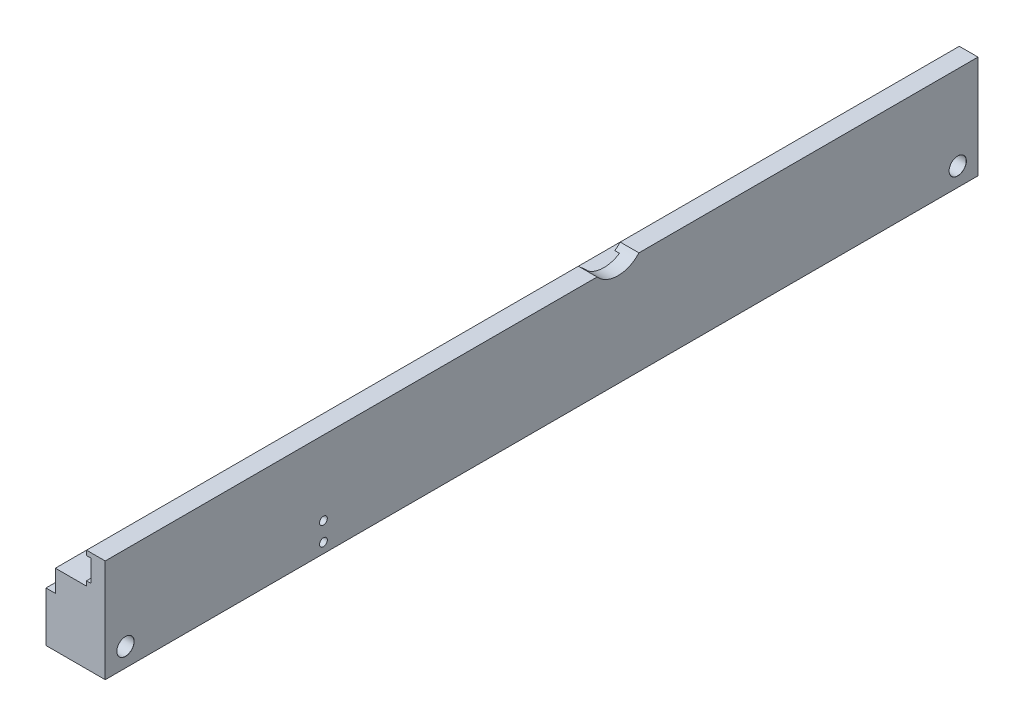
ISO-10303-21;
HEADER;
FILE_DESCRIPTION(('STEP AP214'),'2;1');
FILE_NAME('part.step','',(''),(''),'','','');
FILE_SCHEMA(('AUTOMOTIVE_DESIGN { 1 0 10303 214 1 1 1 1 }'));
ENDSEC;
DATA;
#1=APPLICATION_CONTEXT('core data for automotive mechanical design processes');
#2=APPLICATION_PROTOCOL_DEFINITION('international standard','automotive_design',2000,#1);
#3=PRODUCT_CONTEXT('',#1,'mechanical');
#4=PRODUCT('Part','Part','',(#3));
#5=PRODUCT_RELATED_PRODUCT_CATEGORY('part','',(#4));
#6=PRODUCT_DEFINITION_FORMATION('','',#4);
#7=PRODUCT_DEFINITION_CONTEXT('part definition',#1,'design');
#8=PRODUCT_DEFINITION('design','',#6,#7);
#9=PRODUCT_DEFINITION_SHAPE('','',#8);
#10=(LENGTH_UNIT() NAMED_UNIT(*) SI_UNIT(.MILLI.,.METRE.));
#11=(NAMED_UNIT(*) PLANE_ANGLE_UNIT() SI_UNIT($,.RADIAN.));
#12=(NAMED_UNIT(*) SI_UNIT($,.STERADIAN.) SOLID_ANGLE_UNIT());
#13=UNCERTAINTY_MEASURE_WITH_UNIT(LENGTH_MEASURE(1.E-05),#10,'distance_accuracy_value','');
#14=(GEOMETRIC_REPRESENTATION_CONTEXT(3) GLOBAL_UNCERTAINTY_ASSIGNED_CONTEXT((#13)) GLOBAL_UNIT_ASSIGNED_CONTEXT((#10,
#11,#12)) REPRESENTATION_CONTEXT('',''));
#15=CARTESIAN_POINT('',(0.,0.,0.));
#16=DIRECTION('',(0.,0.,1.));
#17=DIRECTION('',(1.,0.,0.));
#18=AXIS2_PLACEMENT_3D('',#15,#16,#17);
#19=CARTESIAN_POINT('',(-159.,251.054588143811,280.));
#20=DIRECTION('',(0.,-1.,0.));
#21=DIRECTION('',(0.,0.,-1.));
#22=AXIS2_PLACEMENT_3D('',#19,#20,#21);
#23=PLANE('',#22);
#24=DIRECTION('',(0.,0.,-1.));
#25=VECTOR('',#24,1.);
#26=CARTESIAN_POINT('',(-165.,251.054588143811,280.));
#27=LINE('',#26,#25);
#28=CARTESIAN_POINT('',(-165.,251.054588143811,108.791796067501));
#29=VERTEX_POINT('',#28);
#30=CARTESIAN_POINT('',(-165.,251.054588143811,0.));
#31=VERTEX_POINT('',#30);
#32=EDGE_CURVE('E330',#29,#31,#27,.T.);
#33=ORIENTED_EDGE('',*,*,#32,.F.);
#34=DIRECTION('',(1.,0.,0.));
#35=VECTOR('',#34,1.);
#36=CARTESIAN_POINT('',(-178.,251.054588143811,108.791796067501));
#37=LINE('',#36,#35);
#38=CARTESIAN_POINT('',(-159.,251.054588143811,108.791796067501));
#39=VERTEX_POINT('',#38);
#40=EDGE_CURVE('E232',#29,#39,#37,.T.);
#41=ORIENTED_EDGE('',*,*,#40,.T.);
#42=DIRECTION('',(0.,0.,-1.));
#43=VECTOR('',#42,1.);
#44=CARTESIAN_POINT('',(-159.,251.054588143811,280.));
#45=LINE('',#44,#43);
#46=CARTESIAN_POINT('',(-159.,251.054588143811,0.));
#47=VERTEX_POINT('',#46);
#48=EDGE_CURVE('E334',#39,#47,#45,.T.);
#49=ORIENTED_EDGE('',*,*,#48,.T.);
#50=DIRECTION('',(-1.,0.,0.));
#51=VECTOR('',#50,1.);
#52=CARTESIAN_POINT('',(-159.,251.054588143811,0.));
#53=LINE('',#52,#51);
#54=EDGE_CURVE('E316',#47,#31,#53,.T.);
#55=ORIENTED_EDGE('',*,*,#54,.T.);
#56=EDGE_LOOP('',(#33,#41,#49,#55));
#57=FACE_BOUND('',#56,.T.);
#58=ADVANCED_FACE('F16',(#57),#23,.F.);
#59=CARTESIAN_POINT('',(-165.,251.054588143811,280.));
#60=DIRECTION('',(1.,0.,0.));
#61=DIRECTION('',(0.,0.,-1.));
#62=AXIS2_PLACEMENT_3D('',#59,#60,#61);
#63=PLANE('',#62);
#64=CARTESIAN_POINT('',(-165.,251.054588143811,280.));
#65=VERTEX_POINT('',#64);
#66=CARTESIAN_POINT('',(-165.,251.054588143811,122.208203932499));
#67=VERTEX_POINT('',#66);
#68=EDGE_CURVE('E331',#65,#67,#27,.T.);
#69=ORIENTED_EDGE('',*,*,#68,.T.);
#70=CARTESIAN_POINT('',(-165.,257.054588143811,115.5));
#71=DIRECTION('',(1.,0.,0.));
#72=DIRECTION('',(0.,0.,-1.));
#73=AXIS2_PLACEMENT_3D('',#70,#71,#72);
#74=CIRCLE('',#73,9.);
#75=CARTESIAN_POINT('',(-165.,249.55458814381,120.474937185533));
#76=VERTEX_POINT('',#75);
#77=EDGE_CURVE('E233',#67,#76,#74,.T.);
#78=ORIENTED_EDGE('',*,*,#77,.T.);
#79=DIRECTION('',(0.,0.,-1.));
#80=VECTOR('',#79,1.);
#81=CARTESIAN_POINT('',(-165.,249.55458814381,280.));
#82=LINE('',#81,#80);
#83=CARTESIAN_POINT('',(-165.,249.55458814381,280.));
#84=VERTEX_POINT('',#83);
#85=EDGE_CURVE('E297',#84,#76,#82,.T.);
#86=ORIENTED_EDGE('',*,*,#85,.F.);
#87=DIRECTION('',(0.,-1.,0.));
#88=VECTOR('',#87,1.);
#89=CARTESIAN_POINT('',(-165.,251.054588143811,280.));
#90=LINE('',#89,#88);
#91=EDGE_CURVE('E306',#65,#84,#90,.T.);
#92=ORIENTED_EDGE('',*,*,#91,.F.);
#93=EDGE_LOOP('',(#69,#78,#86,#92));
#94=FACE_BOUND('',#93,.T.);
#95=ADVANCED_FACE('F365',(#94),#63,.F.);
#96=CARTESIAN_POINT('',(-163.5,249.55458814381,280.));
#97=DIRECTION('',(0.,1.,0.));
#98=DIRECTION('',(0.,0.,1.));
#99=AXIS2_PLACEMENT_3D('',#96,#97,#98);
#100=PLANE('',#99);
#101=ORIENTED_EDGE('',*,*,#85,.T.);
#102=DIRECTION('',(1.,0.,0.));
#103=VECTOR('',#102,1.);
#104=CARTESIAN_POINT('',(-178.,249.55458814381,120.474937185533));
#105=LINE('',#104,#103);
#106=CARTESIAN_POINT('',(-163.5,249.55458814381,120.474937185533));
#107=VERTEX_POINT('',#106);
#108=EDGE_CURVE('E11',#76,#107,#105,.T.);
#109=ORIENTED_EDGE('',*,*,#108,.T.);
#110=DIRECTION('',(0.,0.,-1.));
#111=VECTOR('',#110,1.);
#112=CARTESIAN_POINT('',(-163.5,249.55458814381,280.));
#113=LINE('',#112,#111);
#114=CARTESIAN_POINT('',(-163.5,249.55458814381,280.));
#115=VERTEX_POINT('',#114);
#116=EDGE_CURVE('E293',#115,#107,#113,.T.);
#117=ORIENTED_EDGE('',*,*,#116,.F.);
#118=DIRECTION('',(1.,0.,0.));
#119=VECTOR('',#118,1.);
#120=CARTESIAN_POINT('',(-163.5,249.55458814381,280.));
#121=LINE('',#120,#119);
#122=EDGE_CURVE('E256',#84,#115,#121,.T.);
#123=ORIENTED_EDGE('',*,*,#122,.F.);
#124=EDGE_LOOP('',(#101,#109,#117,#123));
#125=FACE_BOUND('',#124,.T.);
#126=ADVANCED_FACE('F361',(#125),#100,.F.);
#127=CARTESIAN_POINT('',(-159.,218.05458814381,280.));
#128=DIRECTION('',(-1.,0.,0.));
#129=DIRECTION('',(0.,0.,1.));
#130=AXIS2_PLACEMENT_3D('',#127,#128,#129);
#131=PLANE('',#130);
#132=CARTESIAN_POINT('',(-159.,224.05458814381,273.5));
#133=DIRECTION('',(-1.,0.,0.));
#134=DIRECTION('',(0.,0.,1.));
#135=AXIS2_PLACEMENT_3D('',#132,#133,#134);
#136=CIRCLE('',#135,2.775);
#137=CARTESIAN_POINT('',(-159.,224.05458814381,276.275));
#138=VERTEX_POINT('',#137);
#139=EDGE_CURVE('E172',#138,#138,#136,.T.);
#140=ORIENTED_EDGE('',*,*,#139,.T.);
#141=EDGE_LOOP('',(#140));
#142=FACE_BOUND('',#141,.T.);
#143=CARTESIAN_POINT('',(-159.,224.05458814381,6.5));
#144=DIRECTION('',(-1.,0.,0.));
#145=DIRECTION('',(0.,0.,1.));
#146=AXIS2_PLACEMENT_3D('',#143,#144,#145);
#147=CIRCLE('',#146,2.775);
#148=CARTESIAN_POINT('',(-159.,224.05458814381,9.275));
#149=VERTEX_POINT('',#148);
#150=EDGE_CURVE('E193',#149,#149,#147,.T.);
#151=ORIENTED_EDGE('',*,*,#150,.T.);
#152=EDGE_LOOP('',(#151));
#153=FACE_BOUND('',#152,.T.);
#154=CARTESIAN_POINT('',(-159.,221.25458814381,210.));
#155=DIRECTION('',(-1.,0.,0.));
#156=DIRECTION('',(0.,0.,1.));
#157=AXIS2_PLACEMENT_3D('',#154,#155,#156);
#158=CIRCLE('',#157,1.25);
#159=CARTESIAN_POINT('',(-159.,221.25458814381,211.25));
#160=VERTEX_POINT('',#159);
#161=EDGE_CURVE('E217',#160,#160,#158,.T.);
#162=ORIENTED_EDGE('',*,*,#161,.T.);
#163=EDGE_LOOP('',(#162));
#164=FACE_BOUND('',#163,.T.);
#165=CARTESIAN_POINT('',(-159.,227.254588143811,210.));
#166=DIRECTION('',(-1.,0.,0.));
#167=DIRECTION('',(0.,0.,1.));
#168=AXIS2_PLACEMENT_3D('',#165,#166,#167);
#169=CIRCLE('',#168,1.25);
#170=CARTESIAN_POINT('',(-159.,227.254588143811,211.25));
#171=VERTEX_POINT('',#170);
#172=EDGE_CURVE('E223',#171,#171,#169,.T.);
#173=ORIENTED_EDGE('',*,*,#172,.T.);
#174=EDGE_LOOP('',(#173));
#175=FACE_BOUND('',#174,.T.);
#176=ORIENTED_EDGE('',*,*,#48,.F.);
#177=CARTESIAN_POINT('',(-159.,257.054588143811,115.5));
#178=DIRECTION('',(1.,0.,0.));
#179=DIRECTION('',(0.,0.,-1.));
#180=AXIS2_PLACEMENT_3D('',#177,#178,#179);
#181=CIRCLE('',#180,9.);
#182=CARTESIAN_POINT('',(-159.,251.054588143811,122.208203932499));
#183=VERTEX_POINT('',#182);
#184=EDGE_CURVE('E226',#183,#39,#181,.T.);
#185=ORIENTED_EDGE('',*,*,#184,.F.);
#186=CARTESIAN_POINT('',(-159.,251.054588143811,280.));
#187=VERTEX_POINT('',#186);
#188=EDGE_CURVE('E335',#187,#183,#45,.T.);
#189=ORIENTED_EDGE('',*,*,#188,.F.);
#190=DIRECTION('',(0.,1.,0.));
#191=VECTOR('',#190,1.);
#192=CARTESIAN_POINT('',(-159.,218.05458814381,280.));
#193=LINE('',#192,#191);
#194=CARTESIAN_POINT('',(-159.,218.05458814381,280.));
#195=VERTEX_POINT('',#194);
#196=EDGE_CURVE('E300',#195,#187,#193,.T.);
#197=ORIENTED_EDGE('',*,*,#196,.F.);
#198=DIRECTION('',(0.,0.,-1.));
#199=VECTOR('',#198,1.);
#200=CARTESIAN_POINT('',(-159.,218.05458814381,280.));
#201=LINE('',#200,#199);
#202=CARTESIAN_POINT('',(-159.,218.05458814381,0.));
#203=VERTEX_POINT('',#202);
#204=EDGE_CURVE('E313',#195,#203,#201,.T.);
#205=ORIENTED_EDGE('',*,*,#204,.T.);
#206=DIRECTION('',(0.,1.,0.));
#207=VECTOR('',#206,1.);
#208=CARTESIAN_POINT('',(-159.,218.05458814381,0.));
#209=LINE('',#208,#207);
#210=EDGE_CURVE('E288',#203,#47,#209,.T.);
#211=ORIENTED_EDGE('',*,*,#210,.T.);
#212=EDGE_LOOP('',(#176,#185,#189,#197,#205,#211));
#213=FACE_BOUND('',#212,.T.);
#214=ADVANCED_FACE('F18',(#142,#153,#164,#175,#213),#131,.F.);
#215=ORIENTED_EDGE('',*,*,#188,.T.);
#216=DIRECTION('',(1.,0.,0.));
#217=VECTOR('',#216,1.);
#218=CARTESIAN_POINT('',(-178.,251.054588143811,122.208203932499));
#219=LINE('',#218,#217);
#220=EDGE_CURVE('E236',#183,#67,#219,.F.);
#221=ORIENTED_EDGE('',*,*,#220,.T.);
#222=ORIENTED_EDGE('',*,*,#68,.F.);
#223=DIRECTION('',(-1.,0.,0.));
#224=VECTOR('',#223,1.);
#225=CARTESIAN_POINT('',(-159.,251.054588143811,280.));
#226=LINE('',#225,#224);
#227=EDGE_CURVE('E303',#187,#65,#226,.T.);
#228=ORIENTED_EDGE('',*,*,#227,.F.);
#229=EDGE_LOOP('',(#215,#221,#222,#228));
#230=FACE_BOUND('',#229,.T.);
#231=ADVANCED_FACE('F372',(#230),#23,.F.);
#232=CARTESIAN_POINT('',(-165.,249.55458814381,110.525062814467));
#233=VERTEX_POINT('',#232);
#234=CARTESIAN_POINT('',(-165.,249.55458814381,0.));
#235=VERTEX_POINT('',#234);
#236=EDGE_CURVE('E272',#233,#235,#82,.T.);
#237=ORIENTED_EDGE('',*,*,#236,.F.);
#238=EDGE_CURVE('E31',#233,#29,#74,.T.);
#239=ORIENTED_EDGE('',*,*,#238,.T.);
#240=ORIENTED_EDGE('',*,*,#32,.T.);
#241=DIRECTION('',(0.,-1.,0.));
#242=VECTOR('',#241,1.);
#243=CARTESIAN_POINT('',(-165.,251.054588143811,0.));
#244=LINE('',#243,#242);
#245=EDGE_CURVE('E319',#31,#235,#244,.T.);
#246=ORIENTED_EDGE('',*,*,#245,.T.);
#247=EDGE_LOOP('',(#237,#239,#240,#246));
#248=FACE_BOUND('',#247,.T.);
#249=ADVANCED_FACE('F343',(#248),#63,.F.);
#250=CARTESIAN_POINT('',(-178.,218.05458814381,280.));
#251=DIRECTION('',(1.,0.,0.));
#252=DIRECTION('',(0.,0.,-1.));
#253=AXIS2_PLACEMENT_3D('',#250,#251,#252);
#254=PLANE('',#253);
#255=CARTESIAN_POINT('',(-178.,224.05458814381,273.5));
#256=DIRECTION('',(-1.,0.,0.));
#257=DIRECTION('',(0.,0.,1.));
#258=AXIS2_PLACEMENT_3D('',#255,#256,#257);
#259=CIRCLE('',#258,5.025);
#260=CARTESIAN_POINT('',(-178.,224.05458814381,278.525));
#261=VERTEX_POINT('',#260);
#262=EDGE_CURVE('E175',#261,#261,#259,.T.);
#263=ORIENTED_EDGE('',*,*,#262,.F.);
#264=EDGE_LOOP('',(#263));
#265=FACE_BOUND('',#264,.T.);
#266=CARTESIAN_POINT('',(-178.,224.05458814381,6.5));
#267=DIRECTION('',(-1.,0.,0.));
#268=DIRECTION('',(0.,0.,1.));
#269=AXIS2_PLACEMENT_3D('',#266,#267,#268);
#270=CIRCLE('',#269,5.025);
#271=CARTESIAN_POINT('',(-178.,224.05458814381,11.525));
#272=VERTEX_POINT('',#271);
#273=EDGE_CURVE('E196',#272,#272,#270,.T.);
#274=ORIENTED_EDGE('',*,*,#273,.F.);
#275=EDGE_LOOP('',(#274));
#276=FACE_BOUND('',#275,.T.);
#277=CARTESIAN_POINT('',(-178.,221.25458814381,210.));
#278=DIRECTION('',(-1.,0.,0.));
#279=DIRECTION('',(0.,0.,1.));
#280=AXIS2_PLACEMENT_3D('',#277,#278,#279);
#281=CIRCLE('',#280,1.25);
#282=CARTESIAN_POINT('',(-178.,221.25458814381,211.25));
#283=VERTEX_POINT('',#282);
#284=EDGE_CURVE('E214',#283,#283,#281,.T.);
#285=ORIENTED_EDGE('',*,*,#284,.F.);
#286=EDGE_LOOP('',(#285));
#287=FACE_BOUND('',#286,.T.);
#288=CARTESIAN_POINT('',(-178.,227.254588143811,210.));
#289=DIRECTION('',(-1.,0.,0.));
#290=DIRECTION('',(0.,0.,1.));
#291=AXIS2_PLACEMENT_3D('',#288,#289,#290);
#292=CIRCLE('',#291,1.24999999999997);
#293=CARTESIAN_POINT('',(-178.,227.254588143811,211.25));
#294=VERTEX_POINT('',#293);
#295=EDGE_CURVE('E220',#294,#294,#292,.T.);
#296=ORIENTED_EDGE('',*,*,#295,.F.);
#297=EDGE_LOOP('',(#296));
#298=FACE_BOUND('',#297,.T.);
#299=DIRECTION('',(0.,-1.,0.));
#300=VECTOR('',#299,1.);
#301=CARTESIAN_POINT('',(-178.,218.05458814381,280.));
#302=LINE('',#301,#300);
#303=CARTESIAN_POINT('',(-178.,234.05458814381,280.));
#304=VERTEX_POINT('',#303);
#305=CARTESIAN_POINT('',(-178.,218.05458814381,280.));
#306=VERTEX_POINT('',#305);
#307=EDGE_CURVE('E309',#304,#306,#302,.T.);
#308=ORIENTED_EDGE('',*,*,#307,.F.);
#309=DIRECTION('',(0.,0.,-1.));
#310=VECTOR('',#309,1.);
#311=CARTESIAN_POINT('',(-178.,234.05458814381,280.));
#312=LINE('',#311,#310);
#313=CARTESIAN_POINT('',(-178.,234.05458814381,0.));
#314=VERTEX_POINT('',#313);
#315=EDGE_CURVE('E249',#304,#314,#312,.T.);
#316=ORIENTED_EDGE('',*,*,#315,.T.);
#317=DIRECTION('',(0.,-1.,0.));
#318=VECTOR('',#317,1.);
#319=CARTESIAN_POINT('',(-178.,218.05458814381,0.));
#320=LINE('',#319,#318);
#321=CARTESIAN_POINT('',(-178.,218.05458814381,0.));
#322=VERTEX_POINT('',#321);
#323=EDGE_CURVE('E322',#314,#322,#320,.T.);
#324=ORIENTED_EDGE('',*,*,#323,.T.);
#325=DIRECTION('',(0.,0.,-1.));
#326=VECTOR('',#325,1.);
#327=CARTESIAN_POINT('',(-178.,218.05458814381,280.));
#328=LINE('',#327,#326);
#329=EDGE_CURVE('E327',#306,#322,#328,.T.);
#330=ORIENTED_EDGE('',*,*,#329,.F.);
#331=EDGE_LOOP('',(#308,#316,#324,#330));
#332=FACE_BOUND('',#331,.T.);
#333=ADVANCED_FACE('F390',(#265,#276,#287,#298,#332),#254,.F.);
#334=CARTESIAN_POINT('',(-159.,218.05458814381,280.));
#335=DIRECTION('',(0.,1.,0.));
#336=DIRECTION('',(0.,0.,1.));
#337=AXIS2_PLACEMENT_3D('',#334,#335,#336);
#338=PLANE('',#337);
#339=CARTESIAN_POINT('',(-169.,218.05458814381,255.5));
#340=DIRECTION('',(0.,-1.,0.));
#341=DIRECTION('',(0.,0.,-1.));
#342=AXIS2_PLACEMENT_3D('',#339,#340,#341);
#343=CIRCLE('',#342,1.65);
#344=CARTESIAN_POINT('',(-169.,218.05458814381,253.85));
#345=VERTEX_POINT('',#344);
#346=EDGE_CURVE('E150',#345,#345,#343,.T.);
#347=ORIENTED_EDGE('',*,*,#346,.F.);
#348=EDGE_LOOP('',(#347));
#349=FACE_BOUND('',#348,.T.);
#350=CARTESIAN_POINT('',(-169.,218.05458814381,236.5));
#351=DIRECTION('',(0.,-1.,0.));
#352=DIRECTION('',(0.,0.,-1.));
#353=AXIS2_PLACEMENT_3D('',#350,#351,#352);
#354=CIRCLE('',#353,1.65);
#355=CARTESIAN_POINT('',(-169.,218.05458814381,234.85));
#356=VERTEX_POINT('',#355);
#357=EDGE_CURVE('E149',#356,#356,#354,.T.);
#358=ORIENTED_EDGE('',*,*,#357,.F.);
#359=EDGE_LOOP('',(#358));
#360=FACE_BOUND('',#359,.T.);
#361=CARTESIAN_POINT('',(-169.,218.05458814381,122.));
#362=DIRECTION('',(0.,-1.,0.));
#363=DIRECTION('',(0.,0.,-1.));
#364=AXIS2_PLACEMENT_3D('',#361,#362,#363);
#365=CIRCLE('',#364,1.65);
#366=CARTESIAN_POINT('',(-169.,218.05458814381,120.35));
#367=VERTEX_POINT('',#366);
#368=EDGE_CURVE('E160',#367,#367,#365,.T.);
#369=ORIENTED_EDGE('',*,*,#368,.F.);
#370=EDGE_LOOP('',(#369));
#371=FACE_BOUND('',#370,.T.);
#372=CARTESIAN_POINT('',(-169.,218.05458814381,106.));
#373=DIRECTION('',(0.,-1.,0.));
#374=DIRECTION('',(0.,0.,-1.));
#375=AXIS2_PLACEMENT_3D('',#372,#373,#374);
#376=CIRCLE('',#375,1.65);
#377=CARTESIAN_POINT('',(-169.,218.05458814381,104.35));
#378=VERTEX_POINT('',#377);
#379=EDGE_CURVE('E166',#378,#378,#376,.T.);
#380=ORIENTED_EDGE('',*,*,#379,.F.);
#381=EDGE_LOOP('',(#380));
#382=FACE_BOUND('',#381,.T.);
#383=DIRECTION('',(1.,0.,0.));
#384=VECTOR('',#383,1.);
#385=CARTESIAN_POINT('',(-159.,218.05458814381,0.));
#386=LINE('',#385,#384);
#387=EDGE_CURVE('E304',#322,#203,#386,.T.);
#388=ORIENTED_EDGE('',*,*,#387,.T.);
#389=ORIENTED_EDGE('',*,*,#204,.F.);
#390=DIRECTION('',(1.,0.,0.));
#391=VECTOR('',#390,1.);
#392=CARTESIAN_POINT('',(-159.,218.05458814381,280.));
#393=LINE('',#392,#391);
#394=EDGE_CURVE('E311',#306,#195,#393,.T.);
#395=ORIENTED_EDGE('',*,*,#394,.F.);
#396=ORIENTED_EDGE('',*,*,#329,.T.);
#397=EDGE_LOOP('',(#388,#389,#395,#396));
#398=FACE_BOUND('',#397,.T.);
#399=ADVANCED_FACE('F414',(#349,#360,#371,#382,#398),#338,.F.);
#400=CARTESIAN_POINT('',(0.,0.,280.));
#401=DIRECTION('',(0.,0.,1.));
#402=DIRECTION('',(1.,0.,0.));
#403=AXIS2_PLACEMENT_3D('',#400,#401,#402);
#404=PLANE('',#403);
#405=DIRECTION('',(-1.,0.,0.));
#406=VECTOR('',#405,1.);
#407=CARTESIAN_POINT('',(-178.,234.05458814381,280.));
#408=LINE('',#407,#406);
#409=CARTESIAN_POINT('',(-175.,234.05458814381,280.));
#410=VERTEX_POINT('',#409);
#411=EDGE_CURVE('E241',#410,#304,#408,.T.);
#412=ORIENTED_EDGE('',*,*,#411,.T.);
#413=ORIENTED_EDGE('',*,*,#307,.T.);
#414=ORIENTED_EDGE('',*,*,#394,.T.);
#415=ORIENTED_EDGE('',*,*,#196,.T.);
#416=ORIENTED_EDGE('',*,*,#227,.T.);
#417=ORIENTED_EDGE('',*,*,#91,.T.);
#418=ORIENTED_EDGE('',*,*,#122,.T.);
#419=DIRECTION('',(0.,-1.,0.));
#420=VECTOR('',#419,1.);
#421=CARTESIAN_POINT('',(-163.5,242.55458814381,280.));
#422=LINE('',#421,#420);
#423=CARTESIAN_POINT('',(-163.5,242.55458814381,280.));
#424=VERTEX_POINT('',#423);
#425=EDGE_CURVE('E259',#115,#424,#422,.T.);
#426=ORIENTED_EDGE('',*,*,#425,.T.);
#427=DIRECTION('',(-1.,0.,0.));
#428=VECTOR('',#427,1.);
#429=CARTESIAN_POINT('',(-163.5,242.55458814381,280.));
#430=LINE('',#429,#428);
#431=CARTESIAN_POINT('',(-165.,242.55458814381,280.));
#432=VERTEX_POINT('',#431);
#433=EDGE_CURVE('E263',#424,#432,#430,.T.);
#434=ORIENTED_EDGE('',*,*,#433,.T.);
#435=DIRECTION('',(0.,-1.,0.));
#436=VECTOR('',#435,1.);
#437=CARTESIAN_POINT('',(-165.,242.55458814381,280.));
#438=LINE('',#437,#436);
#439=CARTESIAN_POINT('',(-165.,241.05458814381,280.));
#440=VERTEX_POINT('',#439);
#441=EDGE_CURVE('E266',#432,#440,#438,.T.);
#442=ORIENTED_EDGE('',*,*,#441,.T.);
#443=DIRECTION('',(-1.,0.,0.));
#444=VECTOR('',#443,1.);
#445=CARTESIAN_POINT('',(-178.,241.05458814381,280.));
#446=LINE('',#445,#444);
#447=CARTESIAN_POINT('',(-175.,241.05458814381,280.));
#448=VERTEX_POINT('',#447);
#449=EDGE_CURVE('E269',#440,#448,#446,.T.);
#450=ORIENTED_EDGE('',*,*,#449,.T.);
#451=DIRECTION('',(0.,-1.,0.));
#452=VECTOR('',#451,1.);
#453=CARTESIAN_POINT('',(-175.,234.05458814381,280.));
#454=LINE('',#453,#452);
#455=EDGE_CURVE('E39',#448,#410,#454,.T.);
#456=ORIENTED_EDGE('',*,*,#455,.T.);
#457=EDGE_LOOP('',(#412,#413,#414,#415,#416,#417,#418,#426,#434,#442,#450,#456));
#458=FACE_BOUND('',#457,.T.);
#459=ADVANCED_FACE('F367',(#458),#404,.T.);
#460=CARTESIAN_POINT('',(0.,0.,0.));
#461=DIRECTION('',(0.,0.,1.));
#462=DIRECTION('',(1.,0.,0.));
#463=AXIS2_PLACEMENT_3D('',#460,#461,#462);
#464=PLANE('',#463);
#465=ORIENTED_EDGE('',*,*,#323,.F.);
#466=DIRECTION('',(-1.,0.,0.));
#467=VECTOR('',#466,1.);
#468=CARTESIAN_POINT('',(-178.,234.05458814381,0.));
#469=LINE('',#468,#467);
#470=CARTESIAN_POINT('',(-175.,234.05458814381,0.));
#471=VERTEX_POINT('',#470);
#472=EDGE_CURVE('E242',#471,#314,#469,.T.);
#473=ORIENTED_EDGE('',*,*,#472,.F.);
#474=DIRECTION('',(0.,-1.,0.));
#475=VECTOR('',#474,1.);
#476=CARTESIAN_POINT('',(-175.,234.05458814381,0.));
#477=LINE('',#476,#475);
#478=CARTESIAN_POINT('',(-175.,241.05458814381,0.));
#479=VERTEX_POINT('',#478);
#480=EDGE_CURVE('E239',#479,#471,#477,.T.);
#481=ORIENTED_EDGE('',*,*,#480,.F.);
#482=DIRECTION('',(-1.,0.,0.));
#483=VECTOR('',#482,1.);
#484=CARTESIAN_POINT('',(-178.,241.05458814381,0.));
#485=LINE('',#484,#483);
#486=CARTESIAN_POINT('',(-165.,241.05458814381,0.));
#487=VERTEX_POINT('',#486);
#488=EDGE_CURVE('E260',#487,#479,#485,.T.);
#489=ORIENTED_EDGE('',*,*,#488,.F.);
#490=DIRECTION('',(0.,-1.,0.));
#491=VECTOR('',#490,1.);
#492=CARTESIAN_POINT('',(-165.,242.55458814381,0.));
#493=LINE('',#492,#491);
#494=CARTESIAN_POINT('',(-165.,242.55458814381,0.));
#495=VERTEX_POINT('',#494);
#496=EDGE_CURVE('E281',#495,#487,#493,.T.);
#497=ORIENTED_EDGE('',*,*,#496,.F.);
#498=DIRECTION('',(-1.,0.,0.));
#499=VECTOR('',#498,1.);
#500=CARTESIAN_POINT('',(-163.5,242.55458814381,0.));
#501=LINE('',#500,#499);
#502=CARTESIAN_POINT('',(-163.5,242.55458814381,0.));
#503=VERTEX_POINT('',#502);
#504=EDGE_CURVE('E278',#503,#495,#501,.T.);
#505=ORIENTED_EDGE('',*,*,#504,.F.);
#506=DIRECTION('',(0.,-1.,0.));
#507=VECTOR('',#506,1.);
#508=CARTESIAN_POINT('',(-163.5,242.55458814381,0.));
#509=LINE('',#508,#507);
#510=CARTESIAN_POINT('',(-163.5,249.55458814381,0.));
#511=VERTEX_POINT('',#510);
#512=EDGE_CURVE('E275',#511,#503,#509,.T.);
#513=ORIENTED_EDGE('',*,*,#512,.F.);
#514=DIRECTION('',(1.,0.,0.));
#515=VECTOR('',#514,1.);
#516=CARTESIAN_POINT('',(-163.5,249.55458814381,0.));
#517=LINE('',#516,#515);
#518=EDGE_CURVE('E252',#235,#511,#517,.T.);
#519=ORIENTED_EDGE('',*,*,#518,.F.);
#520=ORIENTED_EDGE('',*,*,#245,.F.);
#521=ORIENTED_EDGE('',*,*,#54,.F.);
#522=ORIENTED_EDGE('',*,*,#210,.F.);
#523=ORIENTED_EDGE('',*,*,#387,.F.);
#524=EDGE_LOOP('',(#465,#473,#481,#489,#497,#505,#513,#519,#520,#521,#522,#523));
#525=FACE_BOUND('',#524,.T.);
#526=ADVANCED_FACE('F349',(#525),#464,.F.);
#527=CARTESIAN_POINT('',(-178.,241.05458814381,280.));
#528=DIRECTION('',(0.,-1.,0.));
#529=DIRECTION('',(0.,0.,-1.));
#530=AXIS2_PLACEMENT_3D('',#527,#528,#529);
#531=PLANE('',#530);
#532=ORIENTED_EDGE('',*,*,#488,.T.);
#533=DIRECTION('',(0.,0.,-1.));
#534=VECTOR('',#533,1.);
#535=CARTESIAN_POINT('',(-175.,241.05458814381,280.));
#536=LINE('',#535,#534);
#537=EDGE_CURVE('E245',#448,#479,#536,.T.);
#538=ORIENTED_EDGE('',*,*,#537,.F.);
#539=ORIENTED_EDGE('',*,*,#449,.F.);
#540=DIRECTION('',(0.,0.,-1.));
#541=VECTOR('',#540,1.);
#542=CARTESIAN_POINT('',(-165.,241.05458814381,280.));
#543=LINE('',#542,#541);
#544=EDGE_CURVE('E286',#440,#487,#543,.T.);
#545=ORIENTED_EDGE('',*,*,#544,.T.);
#546=EDGE_LOOP('',(#532,#538,#539,#545));
#547=FACE_BOUND('',#546,.T.);
#548=ADVANCED_FACE('F441',(#547),#531,.F.);
#549=CARTESIAN_POINT('',(-165.,242.55458814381,280.));
#550=DIRECTION('',(1.,0.,0.));
#551=DIRECTION('',(0.,0.,-1.));
#552=AXIS2_PLACEMENT_3D('',#549,#550,#551);
#553=PLANE('',#552);
#554=ORIENTED_EDGE('',*,*,#496,.T.);
#555=ORIENTED_EDGE('',*,*,#544,.F.);
#556=ORIENTED_EDGE('',*,*,#441,.F.);
#557=DIRECTION('',(0.,0.,-1.));
#558=VECTOR('',#557,1.);
#559=CARTESIAN_POINT('',(-165.,242.55458814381,280.));
#560=LINE('',#559,#558);
#561=EDGE_CURVE('E289',#432,#495,#560,.T.);
#562=ORIENTED_EDGE('',*,*,#561,.T.);
#563=EDGE_LOOP('',(#554,#555,#556,#562));
#564=FACE_BOUND('',#563,.T.);
#565=ADVANCED_FACE('F449',(#564),#553,.F.);
#566=CARTESIAN_POINT('',(-163.5,242.55458814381,280.));
#567=DIRECTION('',(0.,-1.,0.));
#568=DIRECTION('',(0.,0.,-1.));
#569=AXIS2_PLACEMENT_3D('',#566,#567,#568);
#570=PLANE('',#569);
#571=ORIENTED_EDGE('',*,*,#504,.T.);
#572=ORIENTED_EDGE('',*,*,#561,.F.);
#573=ORIENTED_EDGE('',*,*,#433,.F.);
#574=DIRECTION('',(0.,0.,-1.));
#575=VECTOR('',#574,1.);
#576=CARTESIAN_POINT('',(-163.5,242.55458814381,280.));
#577=LINE('',#576,#575);
#578=EDGE_CURVE('E291',#424,#503,#577,.T.);
#579=ORIENTED_EDGE('',*,*,#578,.T.);
#580=EDGE_LOOP('',(#571,#572,#573,#579));
#581=FACE_BOUND('',#580,.T.);
#582=ADVANCED_FACE('F446',(#581),#570,.F.);
#583=CARTESIAN_POINT('',(-163.5,242.55458814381,280.));
#584=DIRECTION('',(1.,0.,0.));
#585=DIRECTION('',(0.,0.,-1.));
#586=AXIS2_PLACEMENT_3D('',#583,#584,#585);
#587=PLANE('',#586);
#588=ORIENTED_EDGE('',*,*,#116,.T.);
#589=CARTESIAN_POINT('',(-163.5,257.054588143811,115.5));
#590=DIRECTION('',(1.,0.,0.));
#591=DIRECTION('',(0.,0.,-1.));
#592=AXIS2_PLACEMENT_3D('',#589,#590,#591);
#593=CIRCLE('',#592,9.);
#594=CARTESIAN_POINT('',(-163.5,249.55458814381,110.525062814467));
#595=VERTEX_POINT('',#594);
#596=EDGE_CURVE('E228',#107,#595,#593,.T.);
#597=ORIENTED_EDGE('',*,*,#596,.T.);
#598=EDGE_CURVE('E296',#595,#511,#113,.T.);
#599=ORIENTED_EDGE('',*,*,#598,.T.);
#600=ORIENTED_EDGE('',*,*,#512,.T.);
#601=ORIENTED_EDGE('',*,*,#578,.F.);
#602=ORIENTED_EDGE('',*,*,#425,.F.);
#603=EDGE_LOOP('',(#588,#597,#599,#600,#601,#602));
#604=FACE_BOUND('',#603,.T.);
#605=ADVANCED_FACE('F355',(#604),#587,.F.);
#606=ORIENTED_EDGE('',*,*,#598,.F.);
#607=DIRECTION('',(1.,0.,0.));
#608=VECTOR('',#607,1.);
#609=CARTESIAN_POINT('',(-178.,249.55458814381,110.525062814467));
#610=LINE('',#609,#608);
#611=EDGE_CURVE('E24',#595,#233,#610,.F.);
#612=ORIENTED_EDGE('',*,*,#611,.T.);
#613=ORIENTED_EDGE('',*,*,#236,.T.);
#614=ORIENTED_EDGE('',*,*,#518,.T.);
#615=EDGE_LOOP('',(#606,#612,#613,#614));
#616=FACE_BOUND('',#615,.T.);
#617=ADVANCED_FACE('F340',(#616),#100,.F.);
#618=CARTESIAN_POINT('',(-178.,234.05458814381,280.));
#619=DIRECTION('',(0.,-1.,0.));
#620=DIRECTION('',(0.,0.,-1.));
#621=AXIS2_PLACEMENT_3D('',#618,#619,#620);
#622=PLANE('',#621);
#623=ORIENTED_EDGE('',*,*,#472,.T.);
#624=ORIENTED_EDGE('',*,*,#315,.F.);
#625=ORIENTED_EDGE('',*,*,#411,.F.);
#626=DIRECTION('',(0.,0.,-1.));
#627=VECTOR('',#626,1.);
#628=CARTESIAN_POINT('',(-175.,234.05458814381,280.));
#629=LINE('',#628,#627);
#630=EDGE_CURVE('E253',#410,#471,#629,.T.);
#631=ORIENTED_EDGE('',*,*,#630,.T.);
#632=EDGE_LOOP('',(#623,#624,#625,#631));
#633=FACE_BOUND('',#632,.T.);
#634=ADVANCED_FACE('F423',(#633),#622,.F.);
#635=CARTESIAN_POINT('',(-175.,234.05458814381,280.));
#636=DIRECTION('',(1.,0.,0.));
#637=DIRECTION('',(0.,0.,-1.));
#638=AXIS2_PLACEMENT_3D('',#635,#636,#637);
#639=PLANE('',#638);
#640=ORIENTED_EDGE('',*,*,#480,.T.);
#641=ORIENTED_EDGE('',*,*,#630,.F.);
#642=ORIENTED_EDGE('',*,*,#455,.F.);
#643=ORIENTED_EDGE('',*,*,#537,.T.);
#644=EDGE_LOOP('',(#640,#641,#642,#643));
#645=FACE_BOUND('',#644,.T.);
#646=ADVANCED_FACE('F457',(#645),#639,.F.);
#647=CARTESIAN_POINT('',(-178.,257.054588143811,115.5));
#648=DIRECTION('',(1.,0.,0.));
#649=DIRECTION('',(0.,0.,-1.));
#650=AXIS2_PLACEMENT_3D('',#647,#648,#649);
#651=CYLINDRICAL_SURFACE('',#650,9.);
#652=ORIENTED_EDGE('',*,*,#184,.T.);
#653=ORIENTED_EDGE('',*,*,#40,.F.);
#654=ORIENTED_EDGE('',*,*,#238,.F.);
#655=ORIENTED_EDGE('',*,*,#611,.F.);
#656=ORIENTED_EDGE('',*,*,#596,.F.);
#657=ORIENTED_EDGE('',*,*,#108,.F.);
#658=ORIENTED_EDGE('',*,*,#77,.F.);
#659=ORIENTED_EDGE('',*,*,#220,.F.);
#660=EDGE_LOOP('',(#652,#653,#654,#655,#656,#657,#658,#659));
#661=FACE_BOUND('',#660,.T.);
#662=ADVANCED_FACE('F358',(#661),#651,.F.);
#663=CARTESIAN_POINT('',(-178.,227.254588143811,210.));
#664=DIRECTION('',(-1.,0.,0.));
#665=DIRECTION('',(0.,0.,1.));
#666=AXIS2_PLACEMENT_3D('',#663,#664,#665);
#667=CYLINDRICAL_SURFACE('',#666,1.24999999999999);
#668=ORIENTED_EDGE('',*,*,#172,.F.);
#669=EDGE_LOOP('',(#668));
#670=FACE_BOUND('',#669,.T.);
#671=ORIENTED_EDGE('',*,*,#295,.T.);
#672=EDGE_LOOP('',(#671));
#673=FACE_BOUND('',#672,.T.);
#674=ADVANCED_FACE('F405',(#670,#673),#667,.F.);
#675=CARTESIAN_POINT('',(-178.,221.25458814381,210.));
#676=DIRECTION('',(-1.,0.,0.));
#677=DIRECTION('',(0.,0.,1.));
#678=AXIS2_PLACEMENT_3D('',#675,#676,#677);
#679=CYLINDRICAL_SURFACE('',#678,1.25);
#680=ORIENTED_EDGE('',*,*,#161,.F.);
#681=EDGE_LOOP('',(#680));
#682=FACE_BOUND('',#681,.T.);
#683=ORIENTED_EDGE('',*,*,#284,.T.);
#684=EDGE_LOOP('',(#683));
#685=FACE_BOUND('',#684,.T.);
#686=ADVANCED_FACE('F408',(#682,#685),#679,.F.);
#687=CARTESIAN_POINT('',(-159.025,224.05458814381,6.5));
#688=DIRECTION('',(1.,0.,0.));
#689=DIRECTION('',(0.,0.,-1.));
#690=AXIS2_PLACEMENT_3D('',#687,#688,#689);
#691=CONICAL_SURFACE('',#690,2.75,0.785398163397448);
#692=ORIENTED_EDGE('',*,*,#150,.F.);
#693=EDGE_LOOP('',(#692));
#694=FACE_BOUND('',#693,.T.);
#695=CARTESIAN_POINT('',(-159.025,224.05458814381,6.5));
#696=DIRECTION('',(-1.,0.,0.));
#697=DIRECTION('',(0.,0.,1.));
#698=AXIS2_PLACEMENT_3D('',#695,#696,#697);
#699=CIRCLE('',#698,2.75);
#700=CARTESIAN_POINT('',(-159.025,224.05458814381,9.25));
#701=VERTEX_POINT('',#700);
#702=EDGE_CURVE('E211',#701,#701,#699,.T.);
#703=ORIENTED_EDGE('',*,*,#702,.T.);
#704=EDGE_LOOP('',(#703));
#705=FACE_BOUND('',#704,.T.);
#706=ADVANCED_FACE('F466',(#694,#705),#691,.F.);
#707=CARTESIAN_POINT('',(-178.,224.05458814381,6.5));
#708=DIRECTION('',(-1.,0.,0.));
#709=DIRECTION('',(0.,0.,1.));
#710=AXIS2_PLACEMENT_3D('',#707,#708,#709);
#711=CYLINDRICAL_SURFACE('',#710,2.75);
#712=ORIENTED_EDGE('',*,*,#702,.F.);
#713=EDGE_LOOP('',(#712));
#714=FACE_BOUND('',#713,.T.);
#715=CARTESIAN_POINT('',(-172.275,224.05458814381,6.5));
#716=DIRECTION('',(-1.,0.,0.));
#717=DIRECTION('',(0.,0.,1.));
#718=AXIS2_PLACEMENT_3D('',#715,#716,#717);
#719=CIRCLE('',#718,2.75);
#720=CARTESIAN_POINT('',(-172.275,224.05458814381,9.25));
#721=VERTEX_POINT('',#720);
#722=EDGE_CURVE('E208',#721,#721,#719,.T.);
#723=ORIENTED_EDGE('',*,*,#722,.T.);
#724=EDGE_LOOP('',(#723));
#725=FACE_BOUND('',#724,.T.);
#726=ADVANCED_FACE('F470',(#714,#725),#711,.F.);
#727=CARTESIAN_POINT('',(-172.3,224.05458814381,6.5));
#728=DIRECTION('',(-1.,0.,0.));
#729=DIRECTION('',(0.,0.,1.));
#730=AXIS2_PLACEMENT_3D('',#727,#728,#729);
#731=CONICAL_SURFACE('',#730,2.775,0.785398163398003);
#732=ORIENTED_EDGE('',*,*,#722,.F.);
#733=EDGE_LOOP('',(#732));
#734=FACE_BOUND('',#733,.T.);
#735=CARTESIAN_POINT('',(-172.3,224.05458814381,6.5));
#736=DIRECTION('',(-1.,0.,0.));
#737=DIRECTION('',(0.,0.,1.));
#738=AXIS2_PLACEMENT_3D('',#735,#736,#737);
#739=CIRCLE('',#738,2.775);
#740=CARTESIAN_POINT('',(-172.3,224.05458814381,9.275));
#741=VERTEX_POINT('',#740);
#742=EDGE_CURVE('E205',#741,#741,#739,.T.);
#743=ORIENTED_EDGE('',*,*,#742,.T.);
#744=EDGE_LOOP('',(#743));
#745=FACE_BOUND('',#744,.T.);
#746=ADVANCED_FACE('F474',(#734,#745),#731,.F.);
#747=CARTESIAN_POINT('',(-172.3,226.82958814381,6.5));
#748=DIRECTION('',(1.,0.,0.));
#749=DIRECTION('',(0.,0.,-1.));
#750=AXIS2_PLACEMENT_3D('',#747,#748,#749);
#751=PLANE('',#750);
#752=ORIENTED_EDGE('',*,*,#742,.F.);
#753=EDGE_LOOP('',(#752));
#754=FACE_BOUND('',#753,.T.);
#755=CARTESIAN_POINT('',(-172.3,224.05458814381,6.5));
#756=DIRECTION('',(-1.,0.,0.));
#757=DIRECTION('',(0.,0.,1.));
#758=AXIS2_PLACEMENT_3D('',#755,#756,#757);
#759=CIRCLE('',#758,5.);
#760=CARTESIAN_POINT('',(-172.3,224.05458814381,11.5));
#761=VERTEX_POINT('',#760);
#762=EDGE_CURVE('E202',#761,#761,#759,.T.);
#763=ORIENTED_EDGE('',*,*,#762,.T.);
#764=EDGE_LOOP('',(#763));
#765=FACE_BOUND('',#764,.T.);
#766=ADVANCED_FACE('F478',(#754,#765),#751,.F.);
#767=CARTESIAN_POINT('',(-178.,224.05458814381,6.5));
#768=DIRECTION('',(-1.,0.,0.));
#769=DIRECTION('',(0.,0.,1.));
#770=AXIS2_PLACEMENT_3D('',#767,#768,#769);
#771=CYLINDRICAL_SURFACE('',#770,5.);
#772=ORIENTED_EDGE('',*,*,#762,.F.);
#773=EDGE_LOOP('',(#772));
#774=FACE_BOUND('',#773,.T.);
#775=CARTESIAN_POINT('',(-177.975,224.05458814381,6.5));
#776=DIRECTION('',(-1.,0.,0.));
#777=DIRECTION('',(0.,0.,1.));
#778=AXIS2_PLACEMENT_3D('',#775,#776,#777);
#779=CIRCLE('',#778,5.);
#780=CARTESIAN_POINT('',(-177.975,224.05458814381,11.5));
#781=VERTEX_POINT('',#780);
#782=EDGE_CURVE('E199',#781,#781,#779,.T.);
#783=ORIENTED_EDGE('',*,*,#782,.T.);
#784=EDGE_LOOP('',(#783));
#785=FACE_BOUND('',#784,.T.);
#786=ADVANCED_FACE('F482',(#774,#785),#771,.F.);
#787=CARTESIAN_POINT('',(-178.,224.05458814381,6.5));
#788=DIRECTION('',(-1.,0.,0.));
#789=DIRECTION('',(0.,0.,1.));
#790=AXIS2_PLACEMENT_3D('',#787,#788,#789);
#791=CONICAL_SURFACE('',#790,5.025,0.785398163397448);
#792=ORIENTED_EDGE('',*,*,#782,.F.);
#793=EDGE_LOOP('',(#792));
#794=FACE_BOUND('',#793,.T.);
#795=ORIENTED_EDGE('',*,*,#273,.T.);
#796=EDGE_LOOP('',(#795));
#797=FACE_BOUND('',#796,.T.);
#798=ADVANCED_FACE('F486',(#794,#797),#791,.F.);
#799=CARTESIAN_POINT('',(-159.025,224.05458814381,273.5));
#800=DIRECTION('',(1.,0.,0.));
#801=DIRECTION('',(0.,0.,-1.));
#802=AXIS2_PLACEMENT_3D('',#799,#800,#801);
#803=CONICAL_SURFACE('',#802,2.75,0.785398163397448);
#804=ORIENTED_EDGE('',*,*,#139,.F.);
#805=EDGE_LOOP('',(#804));
#806=FACE_BOUND('',#805,.T.);
#807=CARTESIAN_POINT('',(-159.025,224.05458814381,273.5));
#808=DIRECTION('',(-1.,0.,0.));
#809=DIRECTION('',(0.,0.,1.));
#810=AXIS2_PLACEMENT_3D('',#807,#808,#809);
#811=CIRCLE('',#810,2.75);
#812=CARTESIAN_POINT('',(-159.025,224.05458814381,276.25));
#813=VERTEX_POINT('',#812);
#814=EDGE_CURVE('E190',#813,#813,#811,.T.);
#815=ORIENTED_EDGE('',*,*,#814,.T.);
#816=EDGE_LOOP('',(#815));
#817=FACE_BOUND('',#816,.T.);
#818=ADVANCED_FACE('F490',(#806,#817),#803,.F.);
#819=CARTESIAN_POINT('',(-178.,224.05458814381,273.5));
#820=DIRECTION('',(-1.,0.,0.));
#821=DIRECTION('',(0.,0.,1.));
#822=AXIS2_PLACEMENT_3D('',#819,#820,#821);
#823=CYLINDRICAL_SURFACE('',#822,2.75);
#824=ORIENTED_EDGE('',*,*,#814,.F.);
#825=EDGE_LOOP('',(#824));
#826=FACE_BOUND('',#825,.T.);
#827=CARTESIAN_POINT('',(-172.275,224.05458814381,273.5));
#828=DIRECTION('',(-1.,0.,0.));
#829=DIRECTION('',(0.,0.,1.));
#830=AXIS2_PLACEMENT_3D('',#827,#828,#829);
#831=CIRCLE('',#830,2.75);
#832=CARTESIAN_POINT('',(-172.275,224.05458814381,276.25));
#833=VERTEX_POINT('',#832);
#834=EDGE_CURVE('E187',#833,#833,#831,.T.);
#835=ORIENTED_EDGE('',*,*,#834,.T.);
#836=EDGE_LOOP('',(#835));
#837=FACE_BOUND('',#836,.T.);
#838=ADVANCED_FACE('F494',(#826,#837),#823,.F.);
#839=CARTESIAN_POINT('',(-172.3,224.05458814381,273.5));
#840=DIRECTION('',(-1.,0.,0.));
#841=DIRECTION('',(0.,0.,1.));
#842=AXIS2_PLACEMENT_3D('',#839,#840,#841);
#843=CONICAL_SURFACE('',#842,2.775,0.785398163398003);
#844=ORIENTED_EDGE('',*,*,#834,.F.);
#845=EDGE_LOOP('',(#844));
#846=FACE_BOUND('',#845,.T.);
#847=CARTESIAN_POINT('',(-172.3,224.05458814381,273.5));
#848=DIRECTION('',(-1.,0.,0.));
#849=DIRECTION('',(0.,0.,1.));
#850=AXIS2_PLACEMENT_3D('',#847,#848,#849);
#851=CIRCLE('',#850,2.775);
#852=CARTESIAN_POINT('',(-172.3,224.05458814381,276.275));
#853=VERTEX_POINT('',#852);
#854=EDGE_CURVE('E184',#853,#853,#851,.T.);
#855=ORIENTED_EDGE('',*,*,#854,.T.);
#856=EDGE_LOOP('',(#855));
#857=FACE_BOUND('',#856,.T.);
#858=ADVANCED_FACE('F498',(#846,#857),#843,.F.);
#859=CARTESIAN_POINT('',(-172.3,226.82958814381,273.5));
#860=DIRECTION('',(1.,0.,0.));
#861=DIRECTION('',(0.,0.,-1.));
#862=AXIS2_PLACEMENT_3D('',#859,#860,#861);
#863=PLANE('',#862);
#864=ORIENTED_EDGE('',*,*,#854,.F.);
#865=EDGE_LOOP('',(#864));
#866=FACE_BOUND('',#865,.T.);
#867=CARTESIAN_POINT('',(-172.3,224.05458814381,273.5));
#868=DIRECTION('',(-1.,0.,0.));
#869=DIRECTION('',(0.,0.,1.));
#870=AXIS2_PLACEMENT_3D('',#867,#868,#869);
#871=CIRCLE('',#870,5.);
#872=CARTESIAN_POINT('',(-172.3,224.05458814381,278.5));
#873=VERTEX_POINT('',#872);
#874=EDGE_CURVE('E181',#873,#873,#871,.T.);
#875=ORIENTED_EDGE('',*,*,#874,.T.);
#876=EDGE_LOOP('',(#875));
#877=FACE_BOUND('',#876,.T.);
#878=ADVANCED_FACE('F502',(#866,#877),#863,.F.);
#879=CARTESIAN_POINT('',(-178.,224.05458814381,273.5));
#880=DIRECTION('',(-1.,0.,0.));
#881=DIRECTION('',(0.,0.,1.));
#882=AXIS2_PLACEMENT_3D('',#879,#880,#881);
#883=CYLINDRICAL_SURFACE('',#882,5.);
#884=ORIENTED_EDGE('',*,*,#874,.F.);
#885=EDGE_LOOP('',(#884));
#886=FACE_BOUND('',#885,.T.);
#887=CARTESIAN_POINT('',(-177.975,224.05458814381,273.5));
#888=DIRECTION('',(-1.,0.,0.));
#889=DIRECTION('',(0.,0.,1.));
#890=AXIS2_PLACEMENT_3D('',#887,#888,#889);
#891=CIRCLE('',#890,5.);
#892=CARTESIAN_POINT('',(-177.975,224.05458814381,278.5));
#893=VERTEX_POINT('',#892);
#894=EDGE_CURVE('E178',#893,#893,#891,.T.);
#895=ORIENTED_EDGE('',*,*,#894,.T.);
#896=EDGE_LOOP('',(#895));
#897=FACE_BOUND('',#896,.T.);
#898=ADVANCED_FACE('F506',(#886,#897),#883,.F.);
#899=CARTESIAN_POINT('',(-178.,224.05458814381,273.5));
#900=DIRECTION('',(-1.,0.,0.));
#901=DIRECTION('',(0.,0.,1.));
#902=AXIS2_PLACEMENT_3D('',#899,#900,#901);
#903=CONICAL_SURFACE('',#902,5.025,0.785398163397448);
#904=ORIENTED_EDGE('',*,*,#894,.F.);
#905=EDGE_LOOP('',(#904));
#906=FACE_BOUND('',#905,.T.);
#907=ORIENTED_EDGE('',*,*,#262,.T.);
#908=EDGE_LOOP('',(#907));
#909=FACE_BOUND('',#908,.T.);
#910=ADVANCED_FACE('F510',(#906,#909),#903,.F.);
#911=CARTESIAN_POINT('',(-169.,233.55458814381,106.));
#912=DIRECTION('',(0.,-1.,0.));
#913=DIRECTION('',(0.,0.,-1.));
#914=AXIS2_PLACEMENT_3D('',#911,#912,#913);
#915=CONICAL_SURFACE('',#914,1.65,1.02974425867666);
#916=CARTESIAN_POINT('',(-169.,234.546008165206,106.));
#917=VERTEX_POINT('',#916);
#918=VERTEX_LOOP('',#917);
#919=FACE_BOUND('',#918,.T.);
#920=CARTESIAN_POINT('',(-169.,233.55458814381,106.));
#921=DIRECTION('',(0.,-1.,0.));
#922=DIRECTION('',(0.,0.,-1.));
#923=AXIS2_PLACEMENT_3D('',#920,#921,#922);
#924=CIRCLE('',#923,1.65);
#925=CARTESIAN_POINT('',(-169.,233.55458814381,104.35));
#926=VERTEX_POINT('',#925);
#927=EDGE_CURVE('E169',#926,#926,#924,.T.);
#928=ORIENTED_EDGE('',*,*,#927,.T.);
#929=EDGE_LOOP('',(#928));
#930=FACE_BOUND('',#929,.T.);
#931=ADVANCED_FACE('F514',(#919,#930),#915,.F.);
#932=CARTESIAN_POINT('',(-169.,218.05458814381,106.));
#933=DIRECTION('',(0.,-1.,0.));
#934=DIRECTION('',(0.,0.,-1.));
#935=AXIS2_PLACEMENT_3D('',#932,#933,#934);
#936=CYLINDRICAL_SURFACE('',#935,1.65);
#937=ORIENTED_EDGE('',*,*,#927,.F.);
#938=EDGE_LOOP('',(#937));
#939=FACE_BOUND('',#938,.T.);
#940=ORIENTED_EDGE('',*,*,#379,.T.);
#941=EDGE_LOOP('',(#940));
#942=FACE_BOUND('',#941,.T.);
#943=ADVANCED_FACE('F518',(#939,#942),#936,.F.);
#944=CARTESIAN_POINT('',(-169.,233.55458814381,122.));
#945=DIRECTION('',(0.,-1.,0.));
#946=DIRECTION('',(0.,0.,-1.));
#947=AXIS2_PLACEMENT_3D('',#944,#945,#946);
#948=CONICAL_SURFACE('',#947,1.65,1.02974425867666);
#949=CARTESIAN_POINT('',(-169.,234.546008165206,122.));
#950=VERTEX_POINT('',#949);
#951=VERTEX_LOOP('',#950);
#952=FACE_BOUND('',#951,.T.);
#953=CARTESIAN_POINT('',(-169.,233.55458814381,122.));
#954=DIRECTION('',(0.,-1.,0.));
#955=DIRECTION('',(0.,0.,-1.));
#956=AXIS2_PLACEMENT_3D('',#953,#954,#955);
#957=CIRCLE('',#956,1.65);
#958=CARTESIAN_POINT('',(-169.,233.55458814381,120.35));
#959=VERTEX_POINT('',#958);
#960=EDGE_CURVE('E163',#959,#959,#957,.T.);
#961=ORIENTED_EDGE('',*,*,#960,.T.);
#962=EDGE_LOOP('',(#961));
#963=FACE_BOUND('',#962,.T.);
#964=ADVANCED_FACE('F522',(#952,#963),#948,.F.);
#965=CARTESIAN_POINT('',(-169.,218.05458814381,122.));
#966=DIRECTION('',(0.,-1.,0.));
#967=DIRECTION('',(0.,0.,-1.));
#968=AXIS2_PLACEMENT_3D('',#965,#966,#967);
#969=CYLINDRICAL_SURFACE('',#968,1.65);
#970=ORIENTED_EDGE('',*,*,#960,.F.);
#971=EDGE_LOOP('',(#970));
#972=FACE_BOUND('',#971,.T.);
#973=ORIENTED_EDGE('',*,*,#368,.T.);
#974=EDGE_LOOP('',(#973));
#975=FACE_BOUND('',#974,.T.);
#976=ADVANCED_FACE('F526',(#972,#975),#969,.F.);
#977=CARTESIAN_POINT('',(-169.,233.55458814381,236.5));
#978=DIRECTION('',(0.,-1.,0.));
#979=DIRECTION('',(0.,0.,-1.));
#980=AXIS2_PLACEMENT_3D('',#977,#978,#979);
#981=CONICAL_SURFACE('',#980,1.65,1.02974425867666);
#982=CARTESIAN_POINT('',(-169.,234.546008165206,236.5));
#983=VERTEX_POINT('',#982);
#984=VERTEX_LOOP('',#983);
#985=FACE_BOUND('',#984,.T.);
#986=CARTESIAN_POINT('',(-169.,233.55458814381,236.5));
#987=DIRECTION('',(0.,-1.,0.));
#988=DIRECTION('',(0.,0.,-1.));
#989=AXIS2_PLACEMENT_3D('',#986,#987,#988);
#990=CIRCLE('',#989,1.65);
#991=CARTESIAN_POINT('',(-169.,233.55458814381,234.85));
#992=VERTEX_POINT('',#991);
#993=EDGE_CURVE('E153',#992,#992,#990,.T.);
#994=ORIENTED_EDGE('',*,*,#993,.T.);
#995=EDGE_LOOP('',(#994));
#996=FACE_BOUND('',#995,.T.);
#997=ADVANCED_FACE('F530',(#985,#996),#981,.F.);
#998=CARTESIAN_POINT('',(-169.,218.05458814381,236.5));
#999=DIRECTION('',(0.,-1.,0.));
#1000=DIRECTION('',(0.,0.,-1.));
#1001=AXIS2_PLACEMENT_3D('',#998,#999,#1000);
#1002=CYLINDRICAL_SURFACE('',#1001,1.65);
#1003=ORIENTED_EDGE('',*,*,#993,.F.);
#1004=EDGE_LOOP('',(#1003));
#1005=FACE_BOUND('',#1004,.T.);
#1006=ORIENTED_EDGE('',*,*,#357,.T.);
#1007=EDGE_LOOP('',(#1006));
#1008=FACE_BOUND('',#1007,.T.);
#1009=ADVANCED_FACE('F143',(#1005,#1008),#1002,.F.);
#1010=CARTESIAN_POINT('',(-169.,233.55458814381,255.5));
#1011=DIRECTION('',(0.,-1.,0.));
#1012=DIRECTION('',(0.,0.,-1.));
#1013=AXIS2_PLACEMENT_3D('',#1010,#1011,#1012);
#1014=CONICAL_SURFACE('',#1013,1.65,1.02974425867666);
#1015=CARTESIAN_POINT('',(-169.,234.546008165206,255.5));
#1016=VERTEX_POINT('',#1015);
#1017=VERTEX_LOOP('',#1016);
#1018=FACE_BOUND('',#1017,.T.);
#1019=CARTESIAN_POINT('',(-169.,233.55458814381,255.5));
#1020=DIRECTION('',(0.,-1.,0.));
#1021=DIRECTION('',(0.,0.,-1.));
#1022=AXIS2_PLACEMENT_3D('',#1019,#1020,#1021);
#1023=CIRCLE('',#1022,1.65);
#1024=CARTESIAN_POINT('',(-169.,233.55458814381,253.85));
#1025=VERTEX_POINT('',#1024);
#1026=EDGE_CURVE('E147',#1025,#1025,#1023,.T.);
#1027=ORIENTED_EDGE('',*,*,#1026,.T.);
#1028=EDGE_LOOP('',(#1027));
#1029=FACE_BOUND('',#1028,.T.);
#1030=ADVANCED_FACE('F139',(#1018,#1029),#1014,.F.);
#1031=CARTESIAN_POINT('',(-169.,218.05458814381,255.5));
#1032=DIRECTION('',(0.,-1.,0.));
#1033=DIRECTION('',(0.,0.,-1.));
#1034=AXIS2_PLACEMENT_3D('',#1031,#1032,#1033);
#1035=CYLINDRICAL_SURFACE('',#1034,1.65);
#1036=ORIENTED_EDGE('',*,*,#1026,.F.);
#1037=EDGE_LOOP('',(#1036));
#1038=FACE_BOUND('',#1037,.T.);
#1039=ORIENTED_EDGE('',*,*,#346,.T.);
#1040=EDGE_LOOP('',(#1039));
#1041=FACE_BOUND('',#1040,.T.);
#1042=ADVANCED_FACE('F142',(#1038,#1041),#1035,.F.);
#1043=CLOSED_SHELL('',(#58,#95,#126,#214,#231,#249,#333,#399,#459,#526,#548,#565,#582,#605,#617,
#634,#646,#662,#674,#686,#706,#726,#746,#766,#786,#798,#818,#838,#858,#878,#898,#910,#931,#943,
#964,#976,#997,#1009,#1030,#1042));
#1044=MANIFOLD_SOLID_BREP('B1',#1043);
#1045=ADVANCED_BREP_SHAPE_REPRESENTATION('',(#18,#1044),#14);
#1046=SHAPE_DEFINITION_REPRESENTATION(#9,#1045);
ENDSEC;
END-ISO-10303-21;
